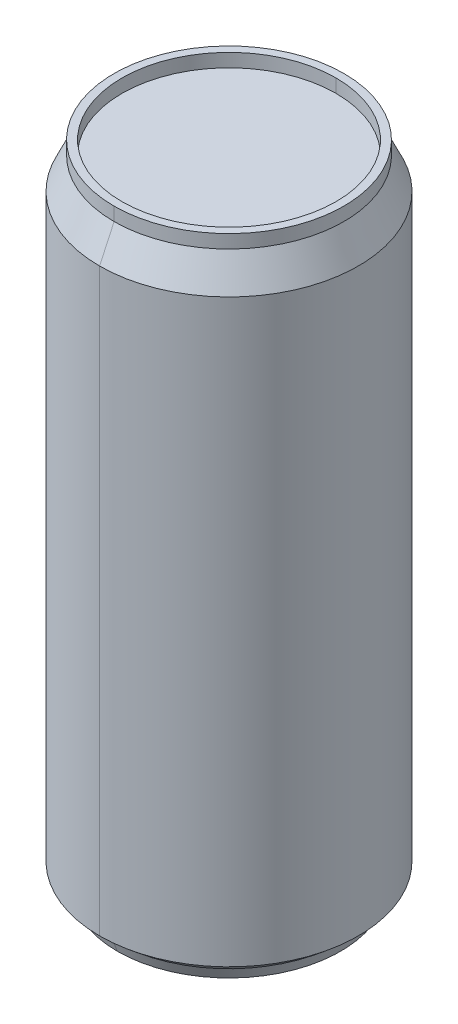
ISO-10303-21;
HEADER;
FILE_DESCRIPTION(('STEP AP214'),'2;1');
FILE_NAME('part.step','',(''),(''),'','','');
FILE_SCHEMA(('AUTOMOTIVE_DESIGN { 1 0 10303 214 1 1 1 1 }'));
ENDSEC;
DATA;
#1=APPLICATION_CONTEXT('core data for automotive mechanical design processes');
#2=APPLICATION_PROTOCOL_DEFINITION('international standard','automotive_design',2000,#1);
#3=PRODUCT_CONTEXT('',#1,'mechanical');
#4=PRODUCT('Part','Part','',(#3));
#5=PRODUCT_RELATED_PRODUCT_CATEGORY('part','',(#4));
#6=PRODUCT_DEFINITION_FORMATION('','',#4);
#7=PRODUCT_DEFINITION_CONTEXT('part definition',#1,'design');
#8=PRODUCT_DEFINITION('design','',#6,#7);
#9=PRODUCT_DEFINITION_SHAPE('','',#8);
#10=(LENGTH_UNIT() NAMED_UNIT(*) SI_UNIT(.MILLI.,.METRE.));
#11=(NAMED_UNIT(*) PLANE_ANGLE_UNIT() SI_UNIT($,.RADIAN.));
#12=(NAMED_UNIT(*) SI_UNIT($,.STERADIAN.) SOLID_ANGLE_UNIT());
#13=UNCERTAINTY_MEASURE_WITH_UNIT(LENGTH_MEASURE(1.E-05),#10,'distance_accuracy_value','');
#14=(GEOMETRIC_REPRESENTATION_CONTEXT(3) GLOBAL_UNCERTAINTY_ASSIGNED_CONTEXT((#13)) GLOBAL_UNIT_ASSIGNED_CONTEXT((#10,
#11,#12)) REPRESENTATION_CONTEXT('',''));
#15=CARTESIAN_POINT('',(0.,0.,0.));
#16=DIRECTION('',(0.,0.,1.));
#17=DIRECTION('',(1.,0.,0.));
#18=AXIS2_PLACEMENT_3D('',#15,#16,#17);
#19=CARTESIAN_POINT('',(0.,-26.0166666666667,0.));
#20=DIRECTION('',(0.,0.,1.));
#21=DIRECTION('',(-1.,0.,0.));
#22=AXIS2_PLACEMENT_3D('',#19,#20,#21);
#23=SPHERICAL_SURFACE('',#22,36.0166666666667);
#24=CARTESIAN_POINT('',(0.,-26.0166666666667,0.));
#25=DIRECTION('',(0.,0.,1.));
#26=DIRECTION('',(1.,0.,0.));
#27=AXIS2_PLACEMENT_3D('',#24,#25,#26);
#28=CIRCLE('',#27,36.0166666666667);
#29=CARTESIAN_POINT('',(22.,2.5,0.));
#30=VERTEX_POINT('',#29);
#31=CARTESIAN_POINT('',(0.,10.,0.));
#32=VERTEX_POINT('',#31);
#33=EDGE_CURVE('E232',#30,#32,#28,.T.);
#34=ORIENTED_EDGE('',*,*,#33,.F.);
#35=CARTESIAN_POINT('',(0.,2.5,0.));
#36=DIRECTION('',(0.,1.,0.));
#37=DIRECTION('',(0.,0.,1.));
#38=AXIS2_PLACEMENT_3D('',#35,#36,#37);
#39=CIRCLE('',#38,22.);
#40=CARTESIAN_POINT('',(0.,2.5,22.));
#41=VERTEX_POINT('',#40);
#42=EDGE_CURVE('E11',#41,#30,#39,.T.);
#43=ORIENTED_EDGE('',*,*,#42,.F.);
#44=CARTESIAN_POINT('',(0.,2.5,0.));
#45=DIRECTION('',(0.,1.,0.));
#46=DIRECTION('',(0.,0.,1.));
#47=AXIS2_PLACEMENT_3D('',#44,#45,#46);
#48=CIRCLE('',#47,22.);
#49=CARTESIAN_POINT('',(-22.,2.5,0.));
#50=VERTEX_POINT('',#49);
#51=EDGE_CURVE('E206',#50,#41,#48,.T.);
#52=ORIENTED_EDGE('',*,*,#51,.F.);
#53=CARTESIAN_POINT('',(0.,-26.0166666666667,0.));
#54=DIRECTION('',(0.,0.,-1.));
#55=DIRECTION('',(-1.,0.,0.));
#56=AXIS2_PLACEMENT_3D('',#53,#54,#55);
#57=CIRCLE('',#56,36.0166666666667);
#58=EDGE_CURVE('E229',#50,#32,#57,.T.);
#59=ORIENTED_EDGE('',*,*,#58,.T.);
#60=EDGE_LOOP('',(#34,#43,#52,#59));
#61=FACE_BOUND('',#60,.T.);
#62=ADVANCED_FACE('F16',(#61),#23,.F.);
#63=CARTESIAN_POINT('',(0.,142.,0.));
#64=DIRECTION('',(0.,1.,0.));
#65=DIRECTION('',(0.,0.,1.));
#66=AXIS2_PLACEMENT_3D('',#63,#64,#65);
#67=CYLINDRICAL_SURFACE('',#66,22.);
#68=DIRECTION('',(0.,1.,0.));
#69=VECTOR('',#68,1.);
#70=CARTESIAN_POINT('',(0.,142.,-22.));
#71=LINE('',#70,#69);
#72=CARTESIAN_POINT('',(0.,0.,-22.));
#73=VERTEX_POINT('',#72);
#74=CARTESIAN_POINT('',(0.,2.5,-22.));
#75=VERTEX_POINT('',#74);
#76=EDGE_CURVE('E211',#73,#75,#71,.T.);
#77=ORIENTED_EDGE('',*,*,#76,.F.);
#78=CARTESIAN_POINT('',(0.,0.,0.));
#79=DIRECTION('',(0.,1.,0.));
#80=DIRECTION('',(0.,0.,1.));
#81=AXIS2_PLACEMENT_3D('',#78,#79,#80);
#82=CIRCLE('',#81,22.);
#83=CARTESIAN_POINT('',(0.,0.,22.));
#84=VERTEX_POINT('',#83);
#85=EDGE_CURVE('E27',#84,#73,#82,.T.);
#86=ORIENTED_EDGE('',*,*,#85,.F.);
#87=DIRECTION('',(0.,1.,0.));
#88=VECTOR('',#87,1.);
#89=CARTESIAN_POINT('',(0.,142.,22.));
#90=LINE('',#89,#88);
#91=EDGE_CURVE('E210',#84,#41,#90,.T.);
#92=ORIENTED_EDGE('',*,*,#91,.T.);
#93=ORIENTED_EDGE('',*,*,#42,.T.);
#94=CARTESIAN_POINT('',(0.,2.5,0.));
#95=DIRECTION('',(0.,1.,0.));
#96=DIRECTION('',(0.,0.,1.));
#97=AXIS2_PLACEMENT_3D('',#94,#95,#96);
#98=CIRCLE('',#97,22.);
#99=EDGE_CURVE('E244',#30,#75,#98,.T.);
#100=ORIENTED_EDGE('',*,*,#99,.T.);
#101=EDGE_LOOP('',(#77,#86,#92,#93,#100));
#102=FACE_BOUND('',#101,.T.);
#103=ADVANCED_FACE('F299',(#102),#67,.F.);
#104=CARTESIAN_POINT('',(-25.,0.,0.));
#105=DIRECTION('',(0.,-1.,0.));
#106=DIRECTION('',(0.,0.,-1.));
#107=AXIS2_PLACEMENT_3D('',#104,#105,#106);
#108=PLANE('',#107);
#109=ORIENTED_EDGE('',*,*,#85,.T.);
#110=CARTESIAN_POINT('',(0.,0.,0.));
#111=DIRECTION('',(0.,1.,0.));
#112=DIRECTION('',(0.,0.,1.));
#113=AXIS2_PLACEMENT_3D('',#110,#111,#112);
#114=CIRCLE('',#113,22.);
#115=EDGE_CURVE('E242',#73,#84,#114,.T.);
#116=ORIENTED_EDGE('',*,*,#115,.T.);
#117=EDGE_LOOP('',(#109,#116));
#118=FACE_BOUND('',#117,.T.);
#119=CARTESIAN_POINT('',(0.,0.,0.));
#120=DIRECTION('',(0.,1.,0.));
#121=DIRECTION('',(0.,0.,1.));
#122=AXIS2_PLACEMENT_3D('',#119,#120,#121);
#123=CIRCLE('',#122,25.);
#124=CARTESIAN_POINT('',(0.,0.,25.));
#125=VERTEX_POINT('',#124);
#126=CARTESIAN_POINT('',(0.,0.,-25.));
#127=VERTEX_POINT('',#126);
#128=EDGE_CURVE('E260',#125,#127,#123,.T.);
#129=ORIENTED_EDGE('',*,*,#128,.F.);
#130=CARTESIAN_POINT('',(0.,0.,0.));
#131=DIRECTION('',(0.,1.,0.));
#132=DIRECTION('',(0.,0.,1.));
#133=AXIS2_PLACEMENT_3D('',#130,#131,#132);
#134=CIRCLE('',#133,25.);
#135=EDGE_CURVE('E202',#127,#125,#134,.T.);
#136=ORIENTED_EDGE('',*,*,#135,.F.);
#137=EDGE_LOOP('',(#129,#136));
#138=FACE_BOUND('',#137,.T.);
#139=ADVANCED_FACE('F297',(#118,#138),#108,.T.);
#140=CARTESIAN_POINT('',(0.,2.5,0.));
#141=DIRECTION('',(0.,1.,0.));
#142=DIRECTION('',(0.,0.,1.));
#143=AXIS2_PLACEMENT_3D('',#140,#141,#142);
#144=CONICAL_SURFACE('',#143,26.,0.380506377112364);
#145=DIRECTION('',(0.,0.92847669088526,-0.371390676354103));
#146=VECTOR('',#145,1.);
#147=CARTESIAN_POINT('',(0.,2.5,-26.));
#148=LINE('',#147,#146);
#149=CARTESIAN_POINT('',(0.,2.5,-26.));
#150=VERTEX_POINT('',#149);
#151=EDGE_CURVE('E217',#127,#150,#148,.T.);
#152=ORIENTED_EDGE('',*,*,#151,.F.);
#153=ORIENTED_EDGE('',*,*,#135,.T.);
#154=DIRECTION('',(0.,0.92847669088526,0.371390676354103));
#155=VECTOR('',#154,1.);
#156=CARTESIAN_POINT('',(0.,2.5,26.));
#157=LINE('',#156,#155);
#158=CARTESIAN_POINT('',(0.,2.5,26.));
#159=VERTEX_POINT('',#158);
#160=EDGE_CURVE('E216',#125,#159,#157,.T.);
#161=ORIENTED_EDGE('',*,*,#160,.T.);
#162=CARTESIAN_POINT('',(0.,2.5,0.));
#163=DIRECTION('',(0.,1.,0.));
#164=DIRECTION('',(0.,0.,1.));
#165=AXIS2_PLACEMENT_3D('',#162,#163,#164);
#166=CIRCLE('',#165,26.);
#167=EDGE_CURVE('E63',#150,#159,#166,.T.);
#168=ORIENTED_EDGE('',*,*,#167,.F.);
#169=EDGE_LOOP('',(#152,#153,#161,#168));
#170=FACE_BOUND('',#169,.T.);
#171=ADVANCED_FACE('F293',(#170),#144,.T.);
#172=CARTESIAN_POINT('',(0.,5.,0.));
#173=DIRECTION('',(0.,1.,0.));
#174=DIRECTION('',(0.,0.,1.));
#175=AXIS2_PLACEMENT_3D('',#172,#173,#174);
#176=CONICAL_SURFACE('',#175,29.,0.876058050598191);
#177=DIRECTION('',(0.,0.640184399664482,-0.768221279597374));
#178=VECTOR('',#177,1.);
#179=CARTESIAN_POINT('',(0.,5.,-29.));
#180=LINE('',#179,#178);
#181=CARTESIAN_POINT('',(0.,5.,-29.));
#182=VERTEX_POINT('',#181);
#183=EDGE_CURVE('E276',#150,#182,#180,.T.);
#184=ORIENTED_EDGE('',*,*,#183,.F.);
#185=ORIENTED_EDGE('',*,*,#167,.T.);
#186=DIRECTION('',(0.,0.640184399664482,0.768221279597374));
#187=VECTOR('',#186,1.);
#188=CARTESIAN_POINT('',(0.,5.,29.));
#189=LINE('',#188,#187);
#190=CARTESIAN_POINT('',(0.,5.,29.));
#191=VERTEX_POINT('',#190);
#192=EDGE_CURVE('E198',#159,#191,#189,.T.);
#193=ORIENTED_EDGE('',*,*,#192,.T.);
#194=CARTESIAN_POINT('',(0.,5.,0.));
#195=DIRECTION('',(0.,1.,0.));
#196=DIRECTION('',(0.,0.,1.));
#197=AXIS2_PLACEMENT_3D('',#194,#195,#196);
#198=CIRCLE('',#197,29.);
#199=EDGE_CURVE('E203',#182,#191,#198,.T.);
#200=ORIENTED_EDGE('',*,*,#199,.F.);
#201=EDGE_LOOP('',(#184,#185,#193,#200));
#202=FACE_BOUND('',#201,.T.);
#203=ADVANCED_FACE('F307',(#202),#176,.T.);
#204=CARTESIAN_POINT('',(0.,142.,0.));
#205=DIRECTION('',(0.,1.,0.));
#206=DIRECTION('',(0.,0.,1.));
#207=AXIS2_PLACEMENT_3D('',#204,#205,#206);
#208=CYLINDRICAL_SURFACE('',#207,29.);
#209=DIRECTION('',(0.,1.,0.));
#210=VECTOR('',#209,1.);
#211=CARTESIAN_POINT('',(0.,142.,-29.));
#212=LINE('',#211,#210);
#213=CARTESIAN_POINT('',(0.,135.,-29.));
#214=VERTEX_POINT('',#213);
#215=EDGE_CURVE('E262',#182,#214,#212,.T.);
#216=ORIENTED_EDGE('',*,*,#215,.F.);
#217=ORIENTED_EDGE('',*,*,#199,.T.);
#218=DIRECTION('',(0.,1.,0.));
#219=VECTOR('',#218,1.);
#220=CARTESIAN_POINT('',(0.,142.,29.));
#221=LINE('',#220,#219);
#222=CARTESIAN_POINT('',(0.,135.,29.));
#223=VERTEX_POINT('',#222);
#224=EDGE_CURVE('E188',#191,#223,#221,.T.);
#225=ORIENTED_EDGE('',*,*,#224,.T.);
#226=CARTESIAN_POINT('',(0.,135.,0.));
#227=DIRECTION('',(0.,1.,0.));
#228=DIRECTION('',(0.,0.,1.));
#229=AXIS2_PLACEMENT_3D('',#226,#227,#228);
#230=CIRCLE('',#229,29.);
#231=EDGE_CURVE('E149',#214,#223,#230,.T.);
#232=ORIENTED_EDGE('',*,*,#231,.F.);
#233=EDGE_LOOP('',(#216,#217,#225,#232));
#234=FACE_BOUND('',#233,.T.);
#235=ADVANCED_FACE('F554',(#234),#208,.T.);
#236=CARTESIAN_POINT('',(0.,142.,0.));
#237=DIRECTION('',(0.,-1.,0.));
#238=DIRECTION('',(0.,0.,-1.));
#239=AXIS2_PLACEMENT_3D('',#236,#237,#238);
#240=CONICAL_SURFACE('',#239,25.75,0.434670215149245);
#241=DIRECTION('',(0.,-0.907008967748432,0.421111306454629));
#242=VECTOR('',#241,1.);
#243=CARTESIAN_POINT('',(0.,142.,25.75));
#244=LINE('',#243,#242);
#245=CARTESIAN_POINT('',(0.,142.,25.75));
#246=VERTEX_POINT('',#245);
#247=EDGE_CURVE('E178',#246,#223,#244,.T.);
#248=ORIENTED_EDGE('',*,*,#247,.F.);
#249=CARTESIAN_POINT('',(0.,142.,0.));
#250=DIRECTION('',(0.,1.,0.));
#251=DIRECTION('',(0.,0.,1.));
#252=AXIS2_PLACEMENT_3D('',#249,#250,#251);
#253=CIRCLE('',#252,25.75);
#254=CARTESIAN_POINT('',(0.,142.,-25.75));
#255=VERTEX_POINT('',#254);
#256=EDGE_CURVE('E158',#255,#246,#253,.T.);
#257=ORIENTED_EDGE('',*,*,#256,.F.);
#258=DIRECTION('',(0.,-0.907008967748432,-0.421111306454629));
#259=VECTOR('',#258,1.);
#260=CARTESIAN_POINT('',(0.,142.,-25.75));
#261=LINE('',#260,#259);
#262=EDGE_CURVE('E184',#255,#214,#261,.T.);
#263=ORIENTED_EDGE('',*,*,#262,.T.);
#264=ORIENTED_EDGE('',*,*,#231,.T.);
#265=EDGE_LOOP('',(#248,#257,#263,#264));
#266=FACE_BOUND('',#265,.T.);
#267=ADVANCED_FACE('F179',(#266),#240,.T.);
#268=CARTESIAN_POINT('',(0.,142.,0.));
#269=DIRECTION('',(0.,1.,0.));
#270=DIRECTION('',(0.,0.,1.));
#271=AXIS2_PLACEMENT_3D('',#268,#269,#270);
#272=CYLINDRICAL_SURFACE('',#271,25.75);
#273=DIRECTION('',(0.,1.,0.));
#274=VECTOR('',#273,1.);
#275=CARTESIAN_POINT('',(0.,142.,-25.75));
#276=LINE('',#275,#274);
#277=CARTESIAN_POINT('',(0.,145.,-25.75));
#278=VERTEX_POINT('',#277);
#279=EDGE_CURVE('E164',#255,#278,#276,.T.);
#280=ORIENTED_EDGE('',*,*,#279,.F.);
#281=ORIENTED_EDGE('',*,*,#256,.T.);
#282=DIRECTION('',(0.,1.,0.));
#283=VECTOR('',#282,1.);
#284=CARTESIAN_POINT('',(0.,142.,25.75));
#285=LINE('',#284,#283);
#286=CARTESIAN_POINT('',(0.,145.,25.75));
#287=VERTEX_POINT('',#286);
#288=EDGE_CURVE('E161',#246,#287,#285,.T.);
#289=ORIENTED_EDGE('',*,*,#288,.T.);
#290=CARTESIAN_POINT('',(0.,145.,0.));
#291=DIRECTION('',(0.,1.,0.));
#292=DIRECTION('',(0.,0.,1.));
#293=AXIS2_PLACEMENT_3D('',#290,#291,#292);
#294=CIRCLE('',#293,25.75);
#295=EDGE_CURVE('E167',#278,#287,#294,.T.);
#296=ORIENTED_EDGE('',*,*,#295,.F.);
#297=EDGE_LOOP('',(#280,#281,#289,#296));
#298=FACE_BOUND('',#297,.T.);
#299=ADVANCED_FACE('F160',(#298),#272,.T.);
#300=CARTESIAN_POINT('',(-24.,145.,0.));
#301=DIRECTION('',(0.,1.,0.));
#302=DIRECTION('',(1.,0.,0.));
#303=AXIS2_PLACEMENT_3D('',#300,#301,#302);
#304=PLANE('',#303);
#305=CARTESIAN_POINT('',(0.,145.,0.));
#306=DIRECTION('',(0.,1.,0.));
#307=DIRECTION('',(0.,0.,1.));
#308=AXIS2_PLACEMENT_3D('',#305,#306,#307);
#309=CIRCLE('',#308,24.);
#310=CARTESIAN_POINT('',(0.,145.,24.));
#311=VERTEX_POINT('',#310);
#312=CARTESIAN_POINT('',(0.,145.,-24.));
#313=VERTEX_POINT('',#312);
#314=EDGE_CURVE('E41',#311,#313,#309,.T.);
#315=ORIENTED_EDGE('',*,*,#314,.F.);
#316=CARTESIAN_POINT('',(0.,145.,0.));
#317=DIRECTION('',(0.,1.,0.));
#318=DIRECTION('',(0.,0.,1.));
#319=AXIS2_PLACEMENT_3D('',#316,#317,#318);
#320=CIRCLE('',#319,24.);
#321=EDGE_CURVE('E266',#313,#311,#320,.T.);
#322=ORIENTED_EDGE('',*,*,#321,.F.);
#323=EDGE_LOOP('',(#315,#322));
#324=FACE_BOUND('',#323,.T.);
#325=CARTESIAN_POINT('',(0.,145.,0.));
#326=DIRECTION('',(0.,1.,0.));
#327=DIRECTION('',(0.,0.,1.));
#328=AXIS2_PLACEMENT_3D('',#325,#326,#327);
#329=CIRCLE('',#328,25.75);
#330=EDGE_CURVE('E175',#287,#278,#329,.T.);
#331=ORIENTED_EDGE('',*,*,#330,.T.);
#332=ORIENTED_EDGE('',*,*,#295,.T.);
#333=EDGE_LOOP('',(#331,#332));
#334=FACE_BOUND('',#333,.T.);
#335=ADVANCED_FACE('F18',(#324,#334),#304,.T.);
#336=CARTESIAN_POINT('',(0.,142.,0.));
#337=DIRECTION('',(0.,1.,0.));
#338=DIRECTION('',(0.,0.,1.));
#339=AXIS2_PLACEMENT_3D('',#336,#337,#338);
#340=CYLINDRICAL_SURFACE('',#339,24.);
#341=DIRECTION('',(0.,1.,0.));
#342=VECTOR('',#341,1.);
#343=CARTESIAN_POINT('',(0.,142.,-24.));
#344=LINE('',#343,#342);
#345=CARTESIAN_POINT('',(0.,142.,-24.));
#346=VERTEX_POINT('',#345);
#347=EDGE_CURVE('E273',#346,#313,#344,.T.);
#348=ORIENTED_EDGE('',*,*,#347,.F.);
#349=CARTESIAN_POINT('',(0.,142.,0.));
#350=DIRECTION('',(0.,1.,0.));
#351=DIRECTION('',(0.,0.,1.));
#352=AXIS2_PLACEMENT_3D('',#349,#350,#351);
#353=CIRCLE('',#352,24.);
#354=CARTESIAN_POINT('',(0.,142.,24.));
#355=VERTEX_POINT('',#354);
#356=EDGE_CURVE('E97',#355,#346,#353,.T.);
#357=ORIENTED_EDGE('',*,*,#356,.F.);
#358=DIRECTION('',(0.,1.,0.));
#359=VECTOR('',#358,1.);
#360=CARTESIAN_POINT('',(0.,142.,24.));
#361=LINE('',#360,#359);
#362=EDGE_CURVE('E264',#355,#311,#361,.T.);
#363=ORIENTED_EDGE('',*,*,#362,.T.);
#364=ORIENTED_EDGE('',*,*,#314,.T.);
#365=EDGE_LOOP('',(#348,#357,#363,#364));
#366=FACE_BOUND('',#365,.T.);
#367=ADVANCED_FACE('F321',(#366),#340,.F.);
#368=CARTESIAN_POINT('',(0.,142.,0.));
#369=DIRECTION('',(0.,1.,0.));
#370=DIRECTION('',(1.,0.,0.));
#371=AXIS2_PLACEMENT_3D('',#368,#369,#370);
#372=PLANE('',#371);
#373=ORIENTED_EDGE('',*,*,#356,.T.);
#374=CARTESIAN_POINT('',(0.,142.,0.));
#375=DIRECTION('',(0.,1.,0.));
#376=DIRECTION('',(0.,0.,1.));
#377=AXIS2_PLACEMENT_3D('',#374,#375,#376);
#378=CIRCLE('',#377,24.);
#379=EDGE_CURVE('E177',#346,#355,#378,.T.);
#380=ORIENTED_EDGE('',*,*,#379,.T.);
#381=EDGE_LOOP('',(#373,#380));
#382=FACE_BOUND('',#381,.T.);
#383=ADVANCED_FACE('F323',(#382),#372,.T.);
#384=CARTESIAN_POINT('',(0.,142.,0.));
#385=DIRECTION('',(0.,1.,0.));
#386=DIRECTION('',(0.,0.,1.));
#387=AXIS2_PLACEMENT_3D('',#384,#385,#386);
#388=CYLINDRICAL_SURFACE('',#387,24.);
#389=ORIENTED_EDGE('',*,*,#379,.F.);
#390=ORIENTED_EDGE('',*,*,#347,.T.);
#391=ORIENTED_EDGE('',*,*,#321,.T.);
#392=ORIENTED_EDGE('',*,*,#362,.F.);
#393=EDGE_LOOP('',(#389,#390,#391,#392));
#394=FACE_BOUND('',#393,.T.);
#395=ADVANCED_FACE('F368',(#394),#388,.F.);
#396=CARTESIAN_POINT('',(0.,142.,0.));
#397=DIRECTION('',(0.,1.,0.));
#398=DIRECTION('',(0.,0.,1.));
#399=AXIS2_PLACEMENT_3D('',#396,#397,#398);
#400=CYLINDRICAL_SURFACE('',#399,25.75);
#401=CARTESIAN_POINT('',(0.,142.,0.));
#402=DIRECTION('',(0.,1.,0.));
#403=DIRECTION('',(0.,0.,1.));
#404=AXIS2_PLACEMENT_3D('',#401,#402,#403);
#405=CIRCLE('',#404,25.75);
#406=EDGE_CURVE('E173',#246,#255,#405,.T.);
#407=ORIENTED_EDGE('',*,*,#406,.T.);
#408=ORIENTED_EDGE('',*,*,#279,.T.);
#409=ORIENTED_EDGE('',*,*,#330,.F.);
#410=ORIENTED_EDGE('',*,*,#288,.F.);
#411=EDGE_LOOP('',(#407,#408,#409,#410));
#412=FACE_BOUND('',#411,.T.);
#413=ADVANCED_FACE('F171',(#412),#400,.T.);
#414=CARTESIAN_POINT('',(0.,142.,0.));
#415=DIRECTION('',(0.,-1.,0.));
#416=DIRECTION('',(0.,0.,-1.));
#417=AXIS2_PLACEMENT_3D('',#414,#415,#416);
#418=CONICAL_SURFACE('',#417,25.75,0.434670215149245);
#419=ORIENTED_EDGE('',*,*,#406,.F.);
#420=ORIENTED_EDGE('',*,*,#247,.T.);
#421=CARTESIAN_POINT('',(0.,135.,0.));
#422=DIRECTION('',(0.,1.,0.));
#423=DIRECTION('',(0.,0.,1.));
#424=AXIS2_PLACEMENT_3D('',#421,#422,#423);
#425=CIRCLE('',#424,29.);
#426=EDGE_CURVE('E194',#223,#214,#425,.T.);
#427=ORIENTED_EDGE('',*,*,#426,.T.);
#428=ORIENTED_EDGE('',*,*,#262,.F.);
#429=EDGE_LOOP('',(#419,#420,#427,#428));
#430=FACE_BOUND('',#429,.T.);
#431=ADVANCED_FACE('F186',(#430),#418,.T.);
#432=CARTESIAN_POINT('',(0.,142.,0.));
#433=DIRECTION('',(0.,1.,0.));
#434=DIRECTION('',(0.,0.,1.));
#435=AXIS2_PLACEMENT_3D('',#432,#433,#434);
#436=CYLINDRICAL_SURFACE('',#435,29.);
#437=CARTESIAN_POINT('',(0.,5.,0.));
#438=DIRECTION('',(0.,1.,0.));
#439=DIRECTION('',(0.,0.,1.));
#440=AXIS2_PLACEMENT_3D('',#437,#438,#439);
#441=CIRCLE('',#440,29.);
#442=EDGE_CURVE('E20',#191,#182,#441,.T.);
#443=ORIENTED_EDGE('',*,*,#442,.T.);
#444=ORIENTED_EDGE('',*,*,#215,.T.);
#445=ORIENTED_EDGE('',*,*,#426,.F.);
#446=ORIENTED_EDGE('',*,*,#224,.F.);
#447=EDGE_LOOP('',(#443,#444,#445,#446));
#448=FACE_BOUND('',#447,.T.);
#449=ADVANCED_FACE('F332',(#448),#436,.T.);
#450=CARTESIAN_POINT('',(0.,5.,0.));
#451=DIRECTION('',(0.,1.,0.));
#452=DIRECTION('',(0.,0.,1.));
#453=AXIS2_PLACEMENT_3D('',#450,#451,#452);
#454=CONICAL_SURFACE('',#453,29.,0.876058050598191);
#455=CARTESIAN_POINT('',(0.,2.5,0.));
#456=DIRECTION('',(0.,1.,0.));
#457=DIRECTION('',(0.,0.,1.));
#458=AXIS2_PLACEMENT_3D('',#455,#456,#457);
#459=CIRCLE('',#458,26.);
#460=EDGE_CURVE('E212',#159,#150,#459,.T.);
#461=ORIENTED_EDGE('',*,*,#460,.T.);
#462=ORIENTED_EDGE('',*,*,#183,.T.);
#463=ORIENTED_EDGE('',*,*,#442,.F.);
#464=ORIENTED_EDGE('',*,*,#192,.F.);
#465=EDGE_LOOP('',(#461,#462,#463,#464));
#466=FACE_BOUND('',#465,.T.);
#467=ADVANCED_FACE('F319',(#466),#454,.T.);
#468=CARTESIAN_POINT('',(0.,2.5,0.));
#469=DIRECTION('',(0.,1.,0.));
#470=DIRECTION('',(0.,0.,1.));
#471=AXIS2_PLACEMENT_3D('',#468,#469,#470);
#472=CONICAL_SURFACE('',#471,26.,0.380506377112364);
#473=ORIENTED_EDGE('',*,*,#128,.T.);
#474=ORIENTED_EDGE('',*,*,#151,.T.);
#475=ORIENTED_EDGE('',*,*,#460,.F.);
#476=ORIENTED_EDGE('',*,*,#160,.F.);
#477=EDGE_LOOP('',(#473,#474,#475,#476));
#478=FACE_BOUND('',#477,.T.);
#479=ADVANCED_FACE('F290',(#478),#472,.T.);
#480=CARTESIAN_POINT('',(0.,142.,0.));
#481=DIRECTION('',(0.,1.,0.));
#482=DIRECTION('',(0.,0.,1.));
#483=AXIS2_PLACEMENT_3D('',#480,#481,#482);
#484=CYLINDRICAL_SURFACE('',#483,22.);
#485=ORIENTED_EDGE('',*,*,#115,.F.);
#486=ORIENTED_EDGE('',*,*,#76,.T.);
#487=CARTESIAN_POINT('',(0.,2.5,0.));
#488=DIRECTION('',(0.,1.,0.));
#489=DIRECTION('',(0.,0.,1.));
#490=AXIS2_PLACEMENT_3D('',#487,#488,#489);
#491=CIRCLE('',#490,22.);
#492=EDGE_CURVE('E231',#75,#50,#491,.T.);
#493=ORIENTED_EDGE('',*,*,#492,.T.);
#494=ORIENTED_EDGE('',*,*,#51,.T.);
#495=ORIENTED_EDGE('',*,*,#91,.F.);
#496=EDGE_LOOP('',(#485,#486,#493,#494,#495));
#497=FACE_BOUND('',#496,.T.);
#498=ADVANCED_FACE('F325',(#497),#484,.F.);
#499=CARTESIAN_POINT('',(0.,-26.0166666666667,0.));
#500=DIRECTION('',(0.,0.,1.));
#501=DIRECTION('',(-1.,0.,0.));
#502=AXIS2_PLACEMENT_3D('',#499,#500,#501);
#503=SPHERICAL_SURFACE('',#502,36.0166666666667);
#504=ORIENTED_EDGE('',*,*,#99,.F.);
#505=ORIENTED_EDGE('',*,*,#33,.T.);
#506=ORIENTED_EDGE('',*,*,#58,.F.);
#507=ORIENTED_EDGE('',*,*,#492,.F.);
#508=EDGE_LOOP('',(#504,#505,#506,#507));
#509=FACE_BOUND('',#508,.T.);
#510=ADVANCED_FACE('F330',(#509),#503,.F.);
#511=CLOSED_SHELL('',(#62,#103,#139,#171,#203,#235,#267,#299,#335,#367,#383,#395,#413,#431,#449,
#467,#479,#498,#510));
#512=MANIFOLD_SOLID_BREP('B1',#511);
#513=ADVANCED_BREP_SHAPE_REPRESENTATION('',(#18,#512),#14);
#514=SHAPE_DEFINITION_REPRESENTATION(#9,#513);
ENDSEC;
END-ISO-10303-21;
